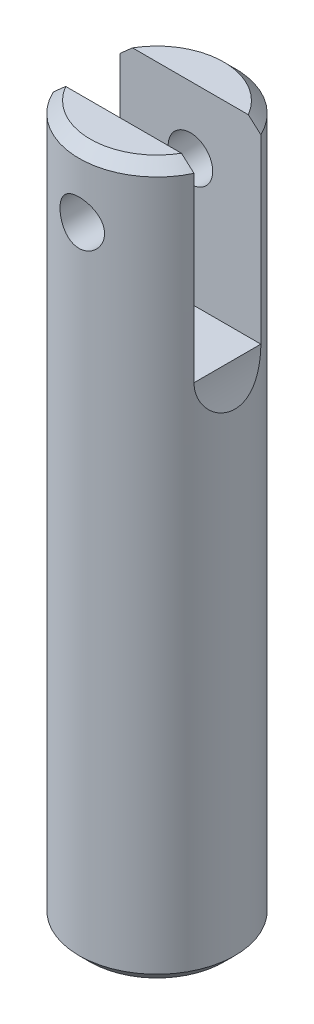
ISO-10303-21;
HEADER;
FILE_DESCRIPTION(('STEP AP214'),'2;1');
FILE_NAME('part.step','',(''),(''),'','','');
FILE_SCHEMA(('AUTOMOTIVE_DESIGN { 1 0 10303 214 1 1 1 1 }'));
ENDSEC;
DATA;
#1=APPLICATION_CONTEXT('core data for automotive mechanical design processes');
#2=APPLICATION_PROTOCOL_DEFINITION('international standard','automotive_design',2000,#1);
#3=PRODUCT_CONTEXT('',#1,'mechanical');
#4=PRODUCT('Part','Part','',(#3));
#5=PRODUCT_RELATED_PRODUCT_CATEGORY('part','',(#4));
#6=PRODUCT_DEFINITION_FORMATION('','',#4);
#7=PRODUCT_DEFINITION_CONTEXT('part definition',#1,'design');
#8=PRODUCT_DEFINITION('design','',#6,#7);
#9=PRODUCT_DEFINITION_SHAPE('','',#8);
#10=(LENGTH_UNIT() NAMED_UNIT(*) SI_UNIT(.MILLI.,.METRE.));
#11=(NAMED_UNIT(*) PLANE_ANGLE_UNIT() SI_UNIT($,.RADIAN.));
#12=(NAMED_UNIT(*) SI_UNIT($,.STERADIAN.) SOLID_ANGLE_UNIT());
#13=UNCERTAINTY_MEASURE_WITH_UNIT(LENGTH_MEASURE(1.E-05),#10,'distance_accuracy_value','');
#14=(GEOMETRIC_REPRESENTATION_CONTEXT(3) GLOBAL_UNCERTAINTY_ASSIGNED_CONTEXT((#13)) GLOBAL_UNIT_ASSIGNED_CONTEXT((#10,
#11,#12)) REPRESENTATION_CONTEXT('',''));
#15=CARTESIAN_POINT('',(0.,0.,0.));
#16=DIRECTION('',(0.,0.,1.));
#17=DIRECTION('',(1.,0.,0.));
#18=AXIS2_PLACEMENT_3D('',#15,#16,#17);
#19=CARTESIAN_POINT('',(0.,50.8,0.));
#20=DIRECTION('',(0.,1.,0.));
#21=DIRECTION('',(0.,0.,1.));
#22=AXIS2_PLACEMENT_3D('',#19,#20,#21);
#23=PLANE('',#22);
#24=DIRECTION('',(1.,0.,0.));
#25=VECTOR('',#24,1.);
#26=CARTESIAN_POINT('',(-9.95086719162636,50.8,2.38125));
#27=LINE('',#26,#25);
#28=CARTESIAN_POINT('',(-4.12444598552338,50.8,2.38125));
#29=VERTEX_POINT('',#28);
#30=CARTESIAN_POINT('',(4.12444598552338,50.8,2.38125));
#31=VERTEX_POINT('',#30);
#32=EDGE_CURVE('E118',#29,#31,#27,.T.);
#33=ORIENTED_EDGE('',*,*,#32,.F.);
#34=CARTESIAN_POINT('',(0.,50.8,0.));
#35=DIRECTION('',(0.,1.,0.));
#36=DIRECTION('',(0.,0.,1.));
#37=AXIS2_PLACEMENT_3D('',#34,#35,#36);
#38=CIRCLE('',#37,4.7625);
#39=EDGE_CURVE('E135',#29,#31,#38,.T.);
#40=ORIENTED_EDGE('',*,*,#39,.T.);
#41=EDGE_LOOP('',(#33,#40));
#42=FACE_BOUND('',#41,.T.);
#43=ADVANCED_FACE('F34',(#42),#23,.T.);
#44=CARTESIAN_POINT('',(0.,50.8,0.));
#45=DIRECTION('',(0.,-1.,0.));
#46=DIRECTION('',(0.,0.,-1.));
#47=AXIS2_PLACEMENT_3D('',#44,#45,#46);
#48=CONICAL_SURFACE('',#47,4.7625,0.785398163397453);
#49=CARTESIAN_POINT('',(-12.0070893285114,43.3215627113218,2.38125));
#50=CARTESIAN_POINT('',(-11.7072816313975,43.6156288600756,2.38125));
#51=CARTESIAN_POINT('',(-11.4072787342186,43.909496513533,2.38125));
#52=CARTESIAN_POINT('',(-10.8063076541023,44.497122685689,2.38125));
#53=CARTESIAN_POINT('',(-10.505338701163,44.7908804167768,2.38125));
#54=CARTESIAN_POINT('',(-9.89524962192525,45.3850048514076,2.38125));
#55=CARTESIAN_POINT('',(-9.58611278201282,45.6853544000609,2.38125));
#56=CARTESIAN_POINT('',(-8.96737458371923,46.2846645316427,2.38125));
#57=CARTESIAN_POINT('',(-8.6577745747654,46.5836265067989,2.38125));
#58=CARTESIAN_POINT('',(-8.06584406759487,47.1528495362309,2.38125));
#59=CARTESIAN_POINT('',(-7.78362212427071,47.4232234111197,2.38125));
#60=CARTESIAN_POINT('',(-7.2177489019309,47.9625727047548,2.38125));
#61=CARTESIAN_POINT('',(-6.93409738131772,48.2315478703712,2.38125));
#62=CARTESIAN_POINT('',(-6.36319908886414,48.7690229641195,2.38125));
#63=CARTESIAN_POINT('',(-6.07594098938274,49.0375108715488,2.38125));
#64=CARTESIAN_POINT('',(-5.49879473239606,49.5712631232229,2.38125));
#65=CARTESIAN_POINT('',(-5.20890849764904,49.8365295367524,2.38125));
#66=CARTESIAN_POINT('',(-4.77419362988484,50.2277580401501,2.38125));
#67=CARTESIAN_POINT('',(-4.6310235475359,50.3555616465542,2.38125));
#68=CARTESIAN_POINT('',(-4.34335865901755,50.6096675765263,2.38125));
#69=CARTESIAN_POINT('',(-4.19886387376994,50.7359699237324,2.38125));
#70=CARTESIAN_POINT('',(-3.90778131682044,50.9869503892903,2.38125));
#71=CARTESIAN_POINT('',(-3.76118892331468,51.1116231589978,2.38125));
#72=CARTESIAN_POINT('',(-3.46579095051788,51.3582832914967,2.38125));
#73=CARTESIAN_POINT('',(-3.31698571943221,51.4802710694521,2.38125));
#74=CARTESIAN_POINT('',(-3.01811805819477,51.7191409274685,2.38125));
#75=CARTESIAN_POINT('',(-2.86808978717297,51.8360656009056,2.38125));
#76=CARTESIAN_POINT('',(-2.56394961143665,52.064776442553,2.38125));
#77=CARTESIAN_POINT('',(-2.40983493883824,52.1765589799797,2.38125));
#78=CARTESIAN_POINT('',(-2.17489544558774,52.3380091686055,2.38125));
#79=CARTESIAN_POINT('',(-2.09613525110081,52.3906773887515,2.38125));
#80=CARTESIAN_POINT('',(-1.93700687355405,52.4935180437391,2.38125));
#81=CARTESIAN_POINT('',(-1.85663889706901,52.5436907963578,2.38125));
#82=CARTESIAN_POINT('',(-1.69411949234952,52.6408301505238,2.38125));
#83=CARTESIAN_POINT('',(-1.61197048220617,52.6878007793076,2.38125));
#84=CARTESIAN_POINT('',(-1.44551541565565,52.7777269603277,2.38125));
#85=CARTESIAN_POINT('',(-1.36121020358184,52.8206840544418,2.38125));
#86=CARTESIAN_POINT('',(-1.23931495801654,52.8782444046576,2.38125));
#87=CARTESIAN_POINT('',(-1.20271623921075,52.8949571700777,2.38125));
#88=CARTESIAN_POINT('',(-1.12904807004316,52.9273519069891,2.38125));
#89=CARTESIAN_POINT('',(-1.09197845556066,52.9430335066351,2.38125));
#90=CARTESIAN_POINT('',(-1.01737472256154,52.9732452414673,2.38125));
#91=CARTESIAN_POINT('',(-0.979840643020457,52.987775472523,2.38125));
#92=CARTESIAN_POINT('',(-0.90430758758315,53.0155626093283,2.38125));
#93=CARTESIAN_POINT('',(-0.866308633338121,53.0288195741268,2.38125));
#94=CARTESIAN_POINT('',(-0.752766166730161,53.0661122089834,2.38125));
#95=CARTESIAN_POINT('',(-0.676543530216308,53.0881355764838,2.38125));
#96=CARTESIAN_POINT('',(-0.522485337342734,53.1257467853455,2.38125));
#97=CARTESIAN_POINT('',(-0.444649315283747,53.1413327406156,2.38125));
#98=CARTESIAN_POINT('',(-0.286153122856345,53.1654231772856,2.38125));
#99=CARTESIAN_POINT('',(-0.205468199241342,53.1737684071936,2.38125));
#100=CARTESIAN_POINT('',(-0.0436891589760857,53.1822185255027,2.38125));
#101=CARTESIAN_POINT('',(0.037404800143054,53.1823263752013,2.38125));
#102=CARTESIAN_POINT('',(0.199257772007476,53.1742970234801,2.38125));
#103=CARTESIAN_POINT('',(0.280016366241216,53.1661515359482,2.38125));
#104=CARTESIAN_POINT('',(0.440388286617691,53.1421702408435,2.38125));
#105=CARTESIAN_POINT('',(0.520001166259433,53.1263315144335,2.38125));
#106=CARTESIAN_POINT('',(0.699426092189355,53.0825766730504,2.38125));
#107=CARTESIAN_POINT('',(0.79871423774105,53.0525289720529,2.38125));
#108=CARTESIAN_POINT('',(0.99417584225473,52.9836734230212,2.38125));
#109=CARTESIAN_POINT('',(1.09034780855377,52.944861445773,2.38125));
#110=CARTESIAN_POINT('',(1.2802989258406,52.8602351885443,2.38125));
#111=CARTESIAN_POINT('',(1.37405762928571,52.8143755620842,2.38125));
#112=CARTESIAN_POINT('',(1.51261599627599,52.7417167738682,2.38125));
#113=CARTESIAN_POINT('',(1.55845118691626,52.7168548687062,2.38125));
#114=CARTESIAN_POINT('',(1.64948649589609,52.6659965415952,2.38125));
#115=CARTESIAN_POINT('',(1.6946866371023,52.6400001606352,2.38125));
#116=CARTESIAN_POINT('',(1.83516527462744,52.5571356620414,2.38125));
#117=CARTESIAN_POINT('',(1.9294162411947,52.4985237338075,2.38125));
#118=CARTESIAN_POINT('',(2.11573035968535,52.3779070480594,2.38125));
#119=CARTESIAN_POINT('',(2.2077930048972,52.3159015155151,2.38125));
#120=CARTESIAN_POINT('',(2.39016718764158,52.1892311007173,2.38125));
#121=CARTESIAN_POINT('',(2.48047734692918,52.124564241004,2.38125));
#122=CARTESIAN_POINT('',(2.65959223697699,51.9931736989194,2.38125));
#123=CARTESIAN_POINT('',(2.74839686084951,51.9264498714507,2.38125));
#124=CARTESIAN_POINT('',(3.01337480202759,51.7235187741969,2.38125));
#125=CARTESIAN_POINT('',(3.18767174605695,51.5848641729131,2.38125));
#126=CARTESIAN_POINT('',(3.53277680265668,51.3032775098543,2.38125));
#127=CARTESIAN_POINT('',(3.70358449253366,51.1603449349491,2.38125));
#128=CARTESIAN_POINT('',(3.95823848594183,50.9434053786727,2.38125));
#129=CARTESIAN_POINT('',(4.04303882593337,50.8705140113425,2.38125));
#130=CARTESIAN_POINT('',(4.21207869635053,50.724093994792,2.38125));
#131=CARTESIAN_POINT('',(4.29631825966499,50.650565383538,2.38125));
#132=CARTESIAN_POINT('',(4.54834231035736,50.4291472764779,2.38125));
#133=CARTESIAN_POINT('',(4.71541126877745,50.280443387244,2.38125));
#134=CARTESIAN_POINT('',(5.04781312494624,49.9816860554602,2.38125));
#135=CARTESIAN_POINT('',(5.21314852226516,49.8316353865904,2.38125));
#136=CARTESIAN_POINT('',(5.54269480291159,49.5303049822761,2.38125));
#137=CARTESIAN_POINT('',(5.70690568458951,49.3790252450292,2.38125));
#138=CARTESIAN_POINT('',(6.13328531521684,48.9839170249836,2.38125));
#139=CARTESIAN_POINT('',(6.39475843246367,48.739338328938,2.38125));
#140=CARTESIAN_POINT('',(6.91609596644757,48.2484677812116,2.38125));
#141=CARTESIAN_POINT('',(7.17596035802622,48.0021759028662,2.38125));
#142=CARTESIAN_POINT('',(7.69467073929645,47.5081811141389,2.38125));
#143=CARTESIAN_POINT('',(7.9535159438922,47.2604773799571,2.38125));
#144=CARTESIAN_POINT('',(8.47030612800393,46.7641326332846,2.38125));
#145=CARTESIAN_POINT('',(8.72825110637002,46.5154916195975,2.38125));
#146=CARTESIAN_POINT('',(9.23873272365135,46.022041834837,2.38125));
#147=CARTESIAN_POINT('',(9.49128200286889,45.7772461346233,2.38125));
#148=CARTESIAN_POINT('',(9.99584755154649,45.2871052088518,2.38125));
#149=CARTESIAN_POINT('',(10.2478638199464,45.0417599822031,2.38125));
#150=CARTESIAN_POINT('',(10.7512821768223,44.5508100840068,2.38125));
#151=CARTESIAN_POINT('',(11.002684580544,44.3052057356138,2.38125));
#152=CARTESIAN_POINT('',(11.5051343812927,43.8136359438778,2.38125));
#153=CARTESIAN_POINT('',(11.7561817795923,43.5676705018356,2.38125));
#154=CARTESIAN_POINT('',(12.0070893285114,43.3215627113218,2.38125));
#155=B_SPLINE_CURVE_WITH_KNOTS('',3,(#49,#50,#51,#52,#53,#54,#55,#56,#57,#58,#59,#60,#61,#62,
#63,#64,#65,#66,#67,#68,#69,#70,#71,#72,#73,#74,#75,#76,#77,#78,#79,#80,#81,#82,#83,#84,#85,#86,
#87,#88,#89,#90,#91,#92,#93,#94,#95,#96,#97,#98,#99,#100,#101,#102,#103,#104,#105,#106,#107,
#108,#109,#110,#111,#112,#113,#114,#115,#116,#117,#118,#119,#120,#121,#122,#123,#124,#125,#126,
#127,#128,#129,#130,#131,#132,#133,#134,#135,#136,#137,#138,#139,#140,#141,#142,#143,#144,#145,
#146,#147,#148,#149,#150,#151,#152,#153,#154),.UNSPECIFIED.,.F.,.F.,(4,2,2,2,2,2,2,2,2,2,2,2,2,
2,2,2,2,2,2,2,2,2,2,2,2,2,2,2,2,2,2,2,2,2,2,2,2,2,2,2,2,2,2,2,2,2,2,2,2,2,2,2,4),(0.,
1.25985599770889,2.52155381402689,3.81460258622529,5.10575192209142,6.27825064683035,
7.45095465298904,8.63053048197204,9.80930361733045,10.3850415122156,10.9607703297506,
11.5380642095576,12.1152681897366,12.6858316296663,13.2567919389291,13.540999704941,
13.8251711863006,14.1089784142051,14.3926761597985,14.5133656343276,14.6340983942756,
14.754821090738,14.8755381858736,15.1133037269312,15.351138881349,15.5940812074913,
15.8369361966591,16.080035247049,16.3232266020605,16.6338881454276,16.9446963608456,
17.2575953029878,17.4140146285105,17.5704283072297,17.9032886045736,18.2362252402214,
18.569413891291,18.9026260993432,19.5706691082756,20.2387925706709,20.5742568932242,
20.9097013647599,21.5806727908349,22.250485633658,22.9202994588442,23.9943832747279,
25.0684838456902,26.1432931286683,27.2181037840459,28.2732589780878,29.3284162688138,
30.382798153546,31.4371762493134),.UNSPECIFIED.);
#156=CARTESIAN_POINT('',(-5.02011578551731,50.00625,2.38125));
#157=VERTEX_POINT('',#156);
#158=EDGE_CURVE('E11',#157,#29,#155,.T.);
#159=ORIENTED_EDGE('',*,*,#158,.F.);
#160=CARTESIAN_POINT('',(0.,50.00625,0.));
#161=DIRECTION('',(0.,1.,0.));
#162=DIRECTION('',(0.,0.,1.));
#163=AXIS2_PLACEMENT_3D('',#160,#161,#162);
#164=CIRCLE('',#163,5.55625);
#165=CARTESIAN_POINT('',(5.0201157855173,50.00625,2.38125));
#166=VERTEX_POINT('',#165);
#167=EDGE_CURVE('E142',#166,#157,#164,.F.);
#168=ORIENTED_EDGE('',*,*,#167,.F.);
#169=EDGE_CURVE('E43',#31,#166,#155,.T.);
#170=ORIENTED_EDGE('',*,*,#169,.F.);
#171=ORIENTED_EDGE('',*,*,#39,.F.);
#172=EDGE_LOOP('',(#159,#168,#170,#171));
#173=FACE_BOUND('',#172,.T.);
#174=ADVANCED_FACE('F175',(#173),#48,.T.);
#175=CARTESIAN_POINT('',(0.,50.8,0.));
#176=DIRECTION('',(0.,-1.,0.));
#177=DIRECTION('',(0.,0.,-1.));
#178=AXIS2_PLACEMENT_3D('',#175,#176,#177);
#179=CYLINDRICAL_SURFACE('',#178,5.55625);
#180=CARTESIAN_POINT('',(0.,47.625,-5.55625));
#181=CARTESIAN_POINT('',(-0.0872767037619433,47.6249984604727,-5.55624896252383));
#182=CARTESIAN_POINT('',(-0.174569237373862,47.6177786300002,-5.55417368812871));
#183=CARTESIAN_POINT('',(-0.34662426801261,47.5891508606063,-5.54609719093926));
#184=CARTESIAN_POINT('',(-0.431385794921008,47.5677375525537,-5.54009448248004));
#185=CARTESIAN_POINT('',(-0.595871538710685,47.5114873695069,-5.52482298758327));
#186=CARTESIAN_POINT('',(-0.675602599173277,47.4766692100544,-5.51555875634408));
#187=CARTESIAN_POINT('',(-0.828094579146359,47.3946712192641,-5.49473420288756));
#188=CARTESIAN_POINT('',(-0.900854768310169,47.3474900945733,-5.48317364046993));
#189=CARTESIAN_POINT('',(-1.03925246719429,47.2407972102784,-5.45865633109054));
#190=CARTESIAN_POINT('',(-1.10468070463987,47.1810201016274,-5.44567302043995));
#191=CARTESIAN_POINT('',(-1.22473351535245,47.0513983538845,-5.4199372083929));
#192=CARTESIAN_POINT('',(-1.27935646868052,46.9815522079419,-5.40718474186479));
#193=CARTESIAN_POINT('',(-1.37731333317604,46.8320488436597,-5.38307768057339));
#194=CARTESIAN_POINT('',(-1.42039833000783,46.7522226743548,-5.37175632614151));
#195=CARTESIAN_POINT('',(-1.49244979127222,46.5860828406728,-5.35218754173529));
#196=CARTESIAN_POINT('',(-1.52141929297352,46.4997705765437,-5.34393945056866));
#197=CARTESIAN_POINT('',(-1.56367506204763,46.3254449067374,-5.33172676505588));
#198=CARTESIAN_POINT('',(-1.57734439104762,46.237531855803,-5.32765776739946));
#199=CARTESIAN_POINT('',(-1.58980717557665,46.0605734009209,-5.32395277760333));
#200=CARTESIAN_POINT('',(-1.58860386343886,45.9715282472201,-5.32431582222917));
#201=CARTESIAN_POINT('',(-1.57165781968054,45.7978917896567,-5.32934096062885));
#202=CARTESIAN_POINT('',(-1.5563875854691,45.7132496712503,-5.33386333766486));
#203=CARTESIAN_POINT('',(-1.51250162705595,45.5477822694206,-5.34647257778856));
#204=CARTESIAN_POINT('',(-1.48388469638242,45.4669573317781,-5.3545597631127));
#205=CARTESIAN_POINT('',(-1.41375353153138,45.3102295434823,-5.37350385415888));
#206=CARTESIAN_POINT('',(-1.37208062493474,45.2344019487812,-5.38439452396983));
#207=CARTESIAN_POINT('',(-1.27713088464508,45.0906542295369,-5.40770140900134));
#208=CARTESIAN_POINT('',(-1.22385146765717,45.0227358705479,-5.42011796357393));
#209=CARTESIAN_POINT('',(-1.1048237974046,44.8940456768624,-5.44565086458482));
#210=CARTESIAN_POINT('',(-1.03868130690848,44.833639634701,-5.45877594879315));
#211=CARTESIAN_POINT('',(-0.897042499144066,44.7246962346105,-5.48383021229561));
#212=CARTESIAN_POINT('',(-0.82154569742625,44.6761594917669,-5.49575932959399));
#213=CARTESIAN_POINT('',(-0.662720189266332,44.5921378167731,-5.51716994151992));
#214=CARTESIAN_POINT('',(-0.579350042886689,44.5567273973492,-5.52663737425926));
#215=CARTESIAN_POINT('',(-0.407505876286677,44.5005349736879,-5.5419565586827));
#216=CARTESIAN_POINT('',(-0.319033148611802,44.4797492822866,-5.54780922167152));
#217=CARTESIAN_POINT('',(-0.142610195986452,44.4539899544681,-5.55509806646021));
#218=CARTESIAN_POINT('',(-0.0547380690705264,44.4485198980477,-5.55667285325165));
#219=CARTESIAN_POINT('',(0.120671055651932,44.4521647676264,-5.55563154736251));
#220=CARTESIAN_POINT('',(0.208208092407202,44.4612779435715,-5.55301595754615));
#221=CARTESIAN_POINT('',(0.378633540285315,44.493426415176,-5.54397804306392));
#222=CARTESIAN_POINT('',(0.461580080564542,44.5161774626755,-5.53763349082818));
#223=CARTESIAN_POINT('',(0.622465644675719,44.5746191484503,-5.52186474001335));
#224=CARTESIAN_POINT('',(0.700404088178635,44.6103112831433,-5.51244018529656));
#225=CARTESIAN_POINT('',(0.850933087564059,44.6944935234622,-5.49124156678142));
#226=CARTESIAN_POINT('',(0.923371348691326,44.743243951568,-5.47942105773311));
#227=CARTESIAN_POINT('',(1.05921058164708,44.8518379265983,-5.45479245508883));
#228=CARTESIAN_POINT('',(1.12260949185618,44.9116839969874,-5.44198413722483));
#229=CARTESIAN_POINT('',(1.24071572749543,45.0430974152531,-5.41630091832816));
#230=CARTESIAN_POINT('',(1.29507093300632,45.1149841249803,-5.40343754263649));
#231=CARTESIAN_POINT('',(1.39096378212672,45.2671359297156,-5.37955247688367));
#232=CARTESIAN_POINT('',(1.43250187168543,45.3474007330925,-5.36853072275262));
#233=CARTESIAN_POINT('',(1.50127854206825,45.5136973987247,-5.34970554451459));
#234=CARTESIAN_POINT('',(1.52859290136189,45.5996958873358,-5.34188511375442));
#235=CARTESIAN_POINT('',(1.5682868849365,45.7753322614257,-5.3303682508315));
#236=CARTESIAN_POINT('',(1.58067103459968,45.8649690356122,-5.32667056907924));
#237=CARTESIAN_POINT('',(1.58986556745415,46.0417037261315,-5.32393289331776));
#238=CARTESIAN_POINT('',(1.58724621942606,46.1287697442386,-5.32472233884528));
#239=CARTESIAN_POINT('',(1.56785239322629,46.301163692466,-5.33046461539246));
#240=CARTESIAN_POINT('',(1.55107838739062,46.3864916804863,-5.335417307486));
#241=CARTESIAN_POINT('',(1.50420362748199,46.5521503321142,-5.34881913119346));
#242=CARTESIAN_POINT('',(1.47424054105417,46.6325230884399,-5.35723208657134));
#243=CARTESIAN_POINT('',(1.4019446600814,46.7871641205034,-5.37660296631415));
#244=CARTESIAN_POINT('',(1.35960967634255,46.8614313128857,-5.38756134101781));
#245=CARTESIAN_POINT('',(1.26211446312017,47.0044331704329,-5.41124512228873));
#246=CARTESIAN_POINT('',(1.20657324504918,47.0729003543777,-5.42401730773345));
#247=CARTESIAN_POINT('',(1.08494499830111,47.1997277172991,-5.44964814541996));
#248=CARTESIAN_POINT('',(1.01885531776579,47.2580853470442,-5.46250681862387));
#249=CARTESIAN_POINT('',(0.875962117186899,47.3645207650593,-5.48725692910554));
#250=CARTESIAN_POINT('',(0.798927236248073,47.4122964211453,-5.49911508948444));
#251=CARTESIAN_POINT('',(0.637580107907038,47.4941469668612,-5.52014545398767));
#252=CARTESIAN_POINT('',(0.553271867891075,47.5282293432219,-5.52931912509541));
#253=CARTESIAN_POINT('',(0.391252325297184,47.5780477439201,-5.54297329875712));
#254=CARTESIAN_POINT('',(0.31413688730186,47.5956102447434,-5.54791311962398));
#255=CARTESIAN_POINT('',(0.158018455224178,47.619086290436,-5.55455172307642));
#256=CARTESIAN_POINT('',(0.0790157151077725,47.6250013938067,-5.55625093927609));
#257=CARTESIAN_POINT('',(0.,47.625,-5.55625));
#258=B_SPLINE_CURVE_WITH_KNOTS('',3,(#180,#181,#182,#183,#184,#185,#186,#187,#188,#189,#190,
#191,#192,#193,#194,#195,#196,#197,#198,#199,#200,#201,#202,#203,#204,#205,#206,#207,#208,#209,
#210,#211,#212,#213,#214,#215,#216,#217,#218,#219,#220,#221,#222,#223,#224,#225,#226,#227,#228,
#229,#230,#231,#232,#233,#234,#235,#236,#237,#238,#239,#240,#241,#242,#243,#244,#245,#246,#247,
#248,#249,#250,#251,#252,#253,#254,#255,#256,#257),.UNSPECIFIED.,.T.,.F.,(4,2,2,2,2,2,2,2,2,2,2,
2,2,2,2,2,2,2,2,2,2,2,2,2,2,2,2,2,2,2,2,2,2,2,2,2,2,2,4),(0.,0.261540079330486,
0.523179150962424,0.78445424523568,1.04575668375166,1.31324200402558,1.5807673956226,
1.85366878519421,2.12651142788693,2.39235860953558,2.65814801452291,2.91532298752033,
3.17252121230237,3.43297512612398,3.69348706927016,3.96381684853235,4.23416063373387,
4.50601636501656,4.77780353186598,5.04067332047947,5.30351156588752,5.56105330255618,
5.81862482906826,6.08177223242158,6.34497955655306,6.6167960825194,6.88860315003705,
7.15894692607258,7.42920873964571,7.68926803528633,7.94931865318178,8.20671695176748,
8.46416082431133,8.73019952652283,8.99630521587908,9.26923770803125,9.54202077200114,
9.77883702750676,10.0156215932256),.UNSPECIFIED.);
#259=CARTESIAN_POINT('',(0.,47.625,-5.55625));
#260=VERTEX_POINT('',#259);
#261=EDGE_CURVE('E95',#260,#260,#258,.T.);
#262=ORIENTED_EDGE('',*,*,#261,.T.);
#263=EDGE_LOOP('',(#262));
#264=FACE_BOUND('',#263,.T.);
#265=CARTESIAN_POINT('',(1.5875,46.0375,5.32463687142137));
#266=CARTESIAN_POINT('',(1.58749842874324,45.9503053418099,5.32463809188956));
#267=CARTESIAN_POINT('',(1.58029169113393,45.863094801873,5.32680211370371));
#268=CARTESIAN_POINT('',(1.55172063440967,45.6912097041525,5.33519371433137));
#269=CARTESIAN_POINT('',(1.53035055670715,45.6065361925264,5.34142294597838));
#270=CARTESIAN_POINT('',(1.47422666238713,45.4422373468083,5.35718313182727));
#271=CARTESIAN_POINT('',(1.43949357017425,45.3626044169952,5.36670897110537));
#272=CARTESIAN_POINT('',(1.35769638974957,45.2102792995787,5.38798231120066));
#273=CARTESIAN_POINT('',(1.31063083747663,45.1375879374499,5.39973007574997));
#274=CARTESIAN_POINT('',(1.20405906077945,44.9991229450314,5.42450165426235));
#275=CARTESIAN_POINT('',(1.14426143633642,44.9335780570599,5.43755068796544));
#276=CARTESIAN_POINT('',(1.01454842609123,44.8132971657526,5.46323810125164));
#277=CARTESIAN_POINT('',(0.944631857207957,44.7585624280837,5.47587643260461));
#278=CARTESIAN_POINT('',(0.795056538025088,44.6604797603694,5.499602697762));
#279=CARTESIAN_POINT('',(0.715240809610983,44.6173624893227,5.51065743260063));
#280=CARTESIAN_POINT('',(0.549122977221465,44.5452485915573,5.5296795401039));
#281=CARTESIAN_POINT('',(0.46282213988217,44.5162492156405,5.53764751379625));
#282=CARTESIAN_POINT('',(0.288574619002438,44.473943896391,5.54941993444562));
#283=CARTESIAN_POINT('',(0.200729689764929,44.4602480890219,5.55332762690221));
#284=CARTESIAN_POINT('',(0.0239078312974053,44.4477086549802,5.55690163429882));
#285=CARTESIAN_POINT('',(-0.065068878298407,44.4488621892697,5.55656875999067));
#286=CARTESIAN_POINT('',(-0.238903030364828,44.4657213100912,5.55177330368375));
#287=CARTESIAN_POINT('',(-0.323805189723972,44.4810051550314,5.5474304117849));
#288=CARTESIAN_POINT('',(-0.489785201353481,44.5250054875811,5.53524647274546));
#289=CARTESIAN_POINT('',(-0.570862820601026,44.5537227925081,5.52740521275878));
#290=CARTESIAN_POINT('',(-0.727927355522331,44.6240768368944,5.50893481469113));
#291=CARTESIAN_POINT('',(-0.803848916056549,44.6658514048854,5.49827613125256));
#292=CARTESIAN_POINT('',(-0.947743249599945,44.7610266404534,5.47530947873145));
#293=CARTESIAN_POINT('',(-1.01571427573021,44.8144298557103,5.4630011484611));
#294=CARTESIAN_POINT('',(-1.14429591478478,44.9335570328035,5.43755010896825));
#295=CARTESIAN_POINT('',(-1.20456450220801,44.999647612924,5.42439327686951));
#296=CARTESIAN_POINT('',(-1.31325383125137,45.1411301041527,5.39911110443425));
#297=CARTESIAN_POINT('',(-1.36167361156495,45.2165227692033,5.38698584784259));
#298=CARTESIAN_POINT('',(-1.44560397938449,45.3752988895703,5.36507670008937));
#299=CARTESIAN_POINT('',(-1.48100841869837,45.4587413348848,5.35531227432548));
#300=CARTESIAN_POINT('',(-1.53716792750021,45.6307453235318,5.33946532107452));
#301=CARTESIAN_POINT('',(-1.55792725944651,45.7193053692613,5.33338172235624));
#302=CARTESIAN_POINT('',(-1.58359012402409,45.8958000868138,5.32581735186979));
#303=CARTESIAN_POINT('',(-1.589009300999,45.9836534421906,5.32418695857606));
#304=CARTESIAN_POINT('',(-1.58526953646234,46.1590138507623,5.32530176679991));
#305=CARTESIAN_POINT('',(-1.5761124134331,46.2465209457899,5.32804642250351));
#306=CARTESIAN_POINT('',(-1.5439372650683,46.4166277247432,5.33745622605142));
#307=CARTESIAN_POINT('',(-1.52124141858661,46.4992938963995,5.34403016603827));
#308=CARTESIAN_POINT('',(-1.46300159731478,46.6596427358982,5.36026569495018));
#309=CARTESIAN_POINT('',(-1.42745576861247,46.7373246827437,5.36992772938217));
#310=CARTESIAN_POINT('',(-1.34351684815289,46.8876237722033,5.39154836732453));
#311=CARTESIAN_POINT('',(-1.29482764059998,46.9600680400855,5.40355787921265));
#312=CARTESIAN_POINT('',(-1.18634243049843,47.0959468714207,5.42840645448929));
#313=CARTESIAN_POINT('',(-1.12654402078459,47.1593794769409,5.44124569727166));
#314=CARTESIAN_POINT('',(-0.995130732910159,47.2776386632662,5.46683189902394));
#315=CARTESIAN_POINT('',(-0.923184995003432,47.3321022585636,5.47956109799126));
#316=CARTESIAN_POINT('',(-0.770878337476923,47.4281862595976,5.50305269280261));
#317=CARTESIAN_POINT('',(-0.690517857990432,47.4698073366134,5.51381519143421));
#318=CARTESIAN_POINT('',(-0.524218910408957,47.5386275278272,5.53209225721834));
#319=CARTESIAN_POINT('',(-0.438328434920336,47.565935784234,5.53963132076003));
#320=CARTESIAN_POINT('',(-0.262926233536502,47.60565377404,5.55072025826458));
#321=CARTESIAN_POINT('',(-0.173415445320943,47.6180673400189,5.55427115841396));
#322=CARTESIAN_POINT('',(0.00331647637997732,47.6273744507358,5.55692734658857));
#323=CARTESIAN_POINT('',(0.0905078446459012,47.6247969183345,5.55618414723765));
#324=CARTESIAN_POINT('',(0.263163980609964,47.6054433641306,5.55068636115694));
#325=CARTESIAN_POINT('',(0.348628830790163,47.5886680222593,5.54593196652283));
#326=CARTESIAN_POINT('',(0.51467078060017,47.541710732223,5.53298361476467));
#327=CARTESIAN_POINT('',(0.595284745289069,47.5116499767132,5.52482078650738));
#328=CARTESIAN_POINT('',(0.750369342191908,47.4390829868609,5.50590318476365));
#329=CARTESIAN_POINT('',(0.824839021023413,47.3965748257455,5.49514801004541));
#330=CARTESIAN_POINT('',(0.967925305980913,47.2988502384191,5.47178670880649));
#331=CARTESIAN_POINT('',(1.03630200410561,47.2432934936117,5.4591350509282));
#332=CARTESIAN_POINT('',(1.16293997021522,47.1216758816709,5.43356851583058));
#333=CARTESIAN_POINT('',(1.22119843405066,47.0556121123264,5.42065356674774));
#334=CARTESIAN_POINT('',(1.32747421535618,46.9127705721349,5.39562704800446));
#335=CARTESIAN_POINT('',(1.37518232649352,46.8357569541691,5.38354549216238));
#336=CARTESIAN_POINT('',(1.45691180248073,46.6744670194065,5.36200703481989));
#337=CARTESIAN_POINT('',(1.49094082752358,46.5901947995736,5.35254866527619));
#338=CARTESIAN_POINT('',(1.54065711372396,46.4282998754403,5.33843277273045));
#339=CARTESIAN_POINT('',(1.55817808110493,46.3512770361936,5.33330498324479));
#340=CARTESIAN_POINT('',(1.58159931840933,46.1953402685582,5.32640674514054));
#341=CARTESIAN_POINT('',(1.58750142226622,46.1164266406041,5.32463576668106));
#342=CARTESIAN_POINT('',(1.5875,46.0375,5.32463687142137));
#343=B_SPLINE_CURVE_WITH_KNOTS('',3,(#265,#266,#267,#268,#269,#270,#271,#272,#273,#274,#275,
#276,#277,#278,#279,#280,#281,#282,#283,#284,#285,#286,#287,#288,#289,#290,#291,#292,#293,#294,
#295,#296,#297,#298,#299,#300,#301,#302,#303,#304,#305,#306,#307,#308,#309,#310,#311,#312,#313,
#314,#315,#316,#317,#318,#319,#320,#321,#322,#323,#324,#325,#326,#327,#328,#329,#330,#331,#332,
#333,#334,#335,#336,#337,#338,#339,#340,#341,#342),.UNSPECIFIED.,.T.,.F.,(4,2,2,2,2,2,2,2,2,2,2,
2,2,2,2,2,2,2,2,2,2,2,2,2,2,2,2,2,2,2,2,2,2,2,2,2,2,2,4),(0.,0.261293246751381,
0.522692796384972,0.783688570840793,1.04471534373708,1.31252251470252,1.58036102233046,
1.8531798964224,2.12594562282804,2.39159177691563,2.65718714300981,2.91510273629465,
3.17303402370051,3.43378554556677,3.69459425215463,3.96455592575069,4.23453949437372,
4.50667850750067,4.77873828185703,5.0415377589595,5.30430445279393,5.56105448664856,
5.81784157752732,6.0809822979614,6.34418010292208,6.61626652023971,6.88833871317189,
7.15830487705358,7.42820156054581,7.68863475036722,7.94905546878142,8.20714808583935,
8.46528067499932,8.73108941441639,8.99697170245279,9.26983804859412,9.54255137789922,
9.77910548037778,10.0156222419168),.UNSPECIFIED.);
#344=CARTESIAN_POINT('',(1.5875,46.0375,5.32463687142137));
#345=VERTEX_POINT('',#344);
#346=EDGE_CURVE('E187',#345,#345,#343,.T.);
#347=ORIENTED_EDGE('',*,*,#346,.T.);
#348=EDGE_LOOP('',(#347));
#349=FACE_BOUND('',#348,.T.);
#350=DIRECTION('',(0.,-1.,0.));
#351=VECTOR('',#350,1.);
#352=CARTESIAN_POINT('',(5.0201157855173,50.8,-2.38125));
#353=LINE('',#352,#351);
#354=CARTESIAN_POINT('',(5.02011578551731,50.00625,-2.38125));
#355=VERTEX_POINT('',#354);
#356=CARTESIAN_POINT('',(5.0201157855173,37.084,-2.38125));
#357=VERTEX_POINT('',#356);
#358=EDGE_CURVE('E113',#355,#357,#353,.T.);
#359=ORIENTED_EDGE('',*,*,#358,.T.);
#360=CARTESIAN_POINT('',(5.0201157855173,37.084,-2.38124999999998));
#361=CARTESIAN_POINT('',(5.02010535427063,37.0096249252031,-2.3812472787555));
#362=CARTESIAN_POINT('',(5.02142229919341,36.9352507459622,-2.37849494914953));
#363=CARTESIAN_POINT('',(5.02663447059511,36.7869928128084,-2.36747296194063));
#364=CARTESIAN_POINT('',(5.030530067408,36.713109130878,-2.3592025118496));
#365=CARTESIAN_POINT('',(5.04083324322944,36.5661968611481,-2.33710425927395));
#366=CARTESIAN_POINT('',(5.04724579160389,36.4931702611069,-2.32326546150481));
#367=CARTESIAN_POINT('',(5.06241583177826,36.3486688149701,-2.29001949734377));
#368=CARTESIAN_POINT('',(5.07117320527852,36.2771938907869,-2.27061261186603));
#369=CARTESIAN_POINT('',(5.10069417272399,36.0656481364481,-2.20391676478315));
#370=CARTESIAN_POINT('',(5.12469897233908,35.9285593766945,-2.14816778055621));
#371=CARTESIAN_POINT('',(5.17873984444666,35.6672458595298,-2.01438010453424));
#372=CARTESIAN_POINT('',(5.20876899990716,35.5430065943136,-1.93636693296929));
#373=CARTESIAN_POINT('',(5.27009649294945,35.3160777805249,-1.76242342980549));
#374=CARTESIAN_POINT('',(5.30129876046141,35.2127338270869,-1.66731648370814));
#375=CARTESIAN_POINT('',(5.36228628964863,35.0253032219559,-1.45928073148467));
#376=CARTESIAN_POINT('',(5.39207180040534,34.9412131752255,-1.34635507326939));
#377=CARTESIAN_POINT('',(5.44453195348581,34.8003129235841,-1.11448890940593));
#378=CARTESIAN_POINT('',(5.46756172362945,34.7419875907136,-0.996547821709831));
#379=CARTESIAN_POINT('',(5.5065917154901,34.6459072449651,-0.751483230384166));
#380=CARTESIAN_POINT('',(5.52259376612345,34.6081468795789,-0.624362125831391));
#381=CARTESIAN_POINT('',(5.54528989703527,34.5552256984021,-0.37044322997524));
#382=CARTESIAN_POINT('',(5.55235327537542,34.5391662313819,-0.243864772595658));
#383=CARTESIAN_POINT('',(5.55769459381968,34.5269883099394,0.0104282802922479));
#384=CARTESIAN_POINT('',(5.55597341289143,34.5308678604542,0.138142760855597));
#385=CARTESIAN_POINT('',(5.54399749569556,34.5583200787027,0.389402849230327));
#386=CARTESIAN_POINT('',(5.53384948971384,34.5816464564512,0.512980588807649));
#387=CARTESIAN_POINT('',(5.50617248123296,34.6472144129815,0.754130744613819));
#388=CARTESIAN_POINT('',(5.48864396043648,34.6894547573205,0.871703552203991));
#389=CARTESIAN_POINT('',(5.44786022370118,34.7921799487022,1.09820327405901));
#390=CARTESIAN_POINT('',(5.42457784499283,34.852751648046,1.20708584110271));
#391=CARTESIAN_POINT('',(5.37466499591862,34.9905763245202,1.41283979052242));
#392=CARTESIAN_POINT('',(5.34803433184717,35.0678302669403,1.5097104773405));
#393=CARTESIAN_POINT('',(5.29330220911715,35.2392445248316,1.6917923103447));
#394=CARTESIAN_POINT('',(5.26518046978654,35.3337999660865,1.77662466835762));
#395=CARTESIAN_POINT('',(5.21087471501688,35.5357189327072,1.93011568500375));
#396=CARTESIAN_POINT('',(5.18469130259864,35.6430864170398,1.99876932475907));
#397=CARTESIAN_POINT('',(5.135250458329,35.8741697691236,2.12269571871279));
#398=CARTESIAN_POINT('',(5.11224617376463,35.9984695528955,2.17697805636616));
#399=CARTESIAN_POINT('',(5.07316002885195,36.2547563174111,2.26657420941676));
#400=CARTESIAN_POINT('',(5.05707859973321,36.3867437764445,2.30188684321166));
#401=CARTESIAN_POINT('',(5.03689100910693,36.6134457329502,2.3456406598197));
#402=CARTESIAN_POINT('',(5.0306190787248,36.7070560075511,2.3590156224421));
#403=CARTESIAN_POINT('',(5.02222409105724,36.8951036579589,2.37680540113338));
#404=CARTESIAN_POINT('',(5.02009204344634,36.9895387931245,2.38123963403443));
#405=CARTESIAN_POINT('',(5.0201157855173,37.084,2.38125));
#406=B_SPLINE_CURVE_WITH_KNOTS('',3,(#360,#361,#362,#363,#364,#365,#366,#367,#368,#369,#370,
#371,#372,#373,#374,#375,#376,#377,#378,#379,#380,#381,#382,#383,#384,#385,#386,#387,#388,#389,
#390,#391,#392,#393,#394,#395,#396,#397,#398,#399,#400,#401,#402,#403,#404,#405),.UNSPECIFIED.,
.F.,.F.,(4,2,2,2,2,2,2,2,2,2,2,2,2,2,2,2,2,2,2,2,2,2,4),(0.,0.223060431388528,0.446152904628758,
0.669688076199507,0.893211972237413,1.34056914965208,1.78741559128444,2.21672418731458,
2.64595702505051,3.04465392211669,3.44324699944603,3.82476873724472,4.20625230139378,
4.58297657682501,4.95967626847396,5.33818943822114,5.71672451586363,6.10533093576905,
6.49405774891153,6.9050271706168,7.3160221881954,7.59984114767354,7.88304306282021),.UNSPECIFIED.);
#407=CARTESIAN_POINT('',(5.0201157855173,37.084,2.38125000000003));
#408=VERTEX_POINT('',#407);
#409=EDGE_CURVE('E107',#357,#408,#406,.T.);
#410=ORIENTED_EDGE('',*,*,#409,.T.);
#411=DIRECTION('',(0.,-1.,0.));
#412=VECTOR('',#411,1.);
#413=CARTESIAN_POINT('',(5.0201157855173,50.8,2.38125));
#414=LINE('',#413,#412);
#415=EDGE_CURVE('E131',#408,#166,#414,.F.);
#416=ORIENTED_EDGE('',*,*,#415,.T.);
#417=ORIENTED_EDGE('',*,*,#167,.T.);
#418=DIRECTION('',(0.,-1.,0.));
#419=VECTOR('',#418,1.);
#420=CARTESIAN_POINT('',(-5.0201157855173,50.8,2.38125));
#421=LINE('',#420,#419);
#422=CARTESIAN_POINT('',(-5.0201157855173,37.084,2.38125));
#423=VERTEX_POINT('',#422);
#424=EDGE_CURVE('E57',#157,#423,#421,.T.);
#425=ORIENTED_EDGE('',*,*,#424,.T.);
#426=CARTESIAN_POINT('',(-5.0201157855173,37.084,2.38125000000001));
#427=CARTESIAN_POINT('',(-5.02010535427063,37.0096249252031,2.38124727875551));
#428=CARTESIAN_POINT('',(-5.02142229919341,36.9352507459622,2.37849494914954));
#429=CARTESIAN_POINT('',(-5.02663447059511,36.7869928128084,2.36747296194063));
#430=CARTESIAN_POINT('',(-5.030530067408,36.713109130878,2.35920251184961));
#431=CARTESIAN_POINT('',(-5.04083324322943,36.5661968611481,2.33710425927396));
#432=CARTESIAN_POINT('',(-5.04724579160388,36.4931702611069,2.32326546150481));
#433=CARTESIAN_POINT('',(-5.06241583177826,36.3486688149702,2.29001949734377));
#434=CARTESIAN_POINT('',(-5.07117320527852,36.2771938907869,2.27061261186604));
#435=CARTESIAN_POINT('',(-5.10069417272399,36.0656481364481,2.20391676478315));
#436=CARTESIAN_POINT('',(-5.12469897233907,35.9285593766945,2.14816778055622));
#437=CARTESIAN_POINT('',(-5.17873984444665,35.6672458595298,2.01438010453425));
#438=CARTESIAN_POINT('',(-5.20876899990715,35.5430065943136,1.9363669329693));
#439=CARTESIAN_POINT('',(-5.27009649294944,35.3160777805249,1.76242342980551));
#440=CARTESIAN_POINT('',(-5.30129876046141,35.2127338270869,1.66731648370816));
#441=CARTESIAN_POINT('',(-5.36228628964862,35.0253032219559,1.45928073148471));
#442=CARTESIAN_POINT('',(-5.39207180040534,34.9412131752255,1.34635507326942));
#443=CARTESIAN_POINT('',(-5.4445319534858,34.8003129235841,1.11448890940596));
#444=CARTESIAN_POINT('',(-5.46756172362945,34.7419875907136,0.996547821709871));
#445=CARTESIAN_POINT('',(-5.50659171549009,34.6459072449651,0.751483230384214));
#446=CARTESIAN_POINT('',(-5.52259376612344,34.6081468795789,0.624362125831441));
#447=CARTESIAN_POINT('',(-5.54528989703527,34.5552256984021,0.370443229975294));
#448=CARTESIAN_POINT('',(-5.55235327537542,34.5391662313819,0.243864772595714));
#449=CARTESIAN_POINT('',(-5.55769459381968,34.5269883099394,-0.0104282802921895));
#450=CARTESIAN_POINT('',(-5.55597341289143,34.5308678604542,-0.138142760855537));
#451=CARTESIAN_POINT('',(-5.54399749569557,34.5583200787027,-0.389402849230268));
#452=CARTESIAN_POINT('',(-5.53384948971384,34.5816464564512,-0.512980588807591));
#453=CARTESIAN_POINT('',(-5.50617248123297,34.6472144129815,-0.754130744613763));
#454=CARTESIAN_POINT('',(-5.48864396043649,34.6894547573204,-0.871703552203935));
#455=CARTESIAN_POINT('',(-5.44786022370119,34.7921799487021,-1.09820327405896));
#456=CARTESIAN_POINT('',(-5.42457784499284,34.852751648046,-1.20708584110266));
#457=CARTESIAN_POINT('',(-5.37466499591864,34.9905763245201,-1.41283979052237));
#458=CARTESIAN_POINT('',(-5.34803433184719,35.0678302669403,-1.50971047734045));
#459=CARTESIAN_POINT('',(-5.29330220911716,35.2392445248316,-1.69179231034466));
#460=CARTESIAN_POINT('',(-5.26518046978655,35.3337999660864,-1.77662466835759));
#461=CARTESIAN_POINT('',(-5.21087471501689,35.5357189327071,-1.93011568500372));
#462=CARTESIAN_POINT('',(-5.18469130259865,35.6430864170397,-1.99876932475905));
#463=CARTESIAN_POINT('',(-5.13525045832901,35.8741697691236,-2.12269571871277));
#464=CARTESIAN_POINT('',(-5.11224617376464,35.9984695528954,-2.17697805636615));
#465=CARTESIAN_POINT('',(-5.07316002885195,36.2547563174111,-2.26657420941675));
#466=CARTESIAN_POINT('',(-5.05707859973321,36.3867437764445,-2.30188684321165));
#467=CARTESIAN_POINT('',(-5.03689100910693,36.6134457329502,-2.34564065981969));
#468=CARTESIAN_POINT('',(-5.03061907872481,36.7070560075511,-2.3590156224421));
#469=CARTESIAN_POINT('',(-5.02222409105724,36.8951036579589,-2.37680540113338));
#470=CARTESIAN_POINT('',(-5.02009204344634,36.9895387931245,-2.38123963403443));
#471=CARTESIAN_POINT('',(-5.0201157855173,37.084,-2.38125));
#472=B_SPLINE_CURVE_WITH_KNOTS('',3,(#426,#427,#428,#429,#430,#431,#432,#433,#434,#435,#436,
#437,#438,#439,#440,#441,#442,#443,#444,#445,#446,#447,#448,#449,#450,#451,#452,#453,#454,#455,
#456,#457,#458,#459,#460,#461,#462,#463,#464,#465,#466,#467,#468,#469,#470,#471),.UNSPECIFIED.,
.F.,.F.,(4,2,2,2,2,2,2,2,2,2,2,2,2,2,2,2,2,2,2,2,2,2,4),(0.,0.223060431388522,0.446152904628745,
0.669688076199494,0.8932119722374,1.34056914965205,1.78741559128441,2.21672418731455,
2.64595702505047,3.04465392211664,3.44324699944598,3.82476873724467,4.20625230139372,
4.58297657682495,4.9596762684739,5.33818943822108,5.71672451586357,6.105330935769,
6.49405774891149,6.90502717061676,7.31602218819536,7.59984114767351,7.88304306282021),.UNSPECIFIED.);
#473=CARTESIAN_POINT('',(-5.0201157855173,37.084,-2.38124999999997));
#474=VERTEX_POINT('',#473);
#475=EDGE_CURVE('E90',#423,#474,#472,.T.);
#476=ORIENTED_EDGE('',*,*,#475,.T.);
#477=DIRECTION('',(0.,-1.,0.));
#478=VECTOR('',#477,1.);
#479=CARTESIAN_POINT('',(-5.0201157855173,50.8,-2.38125));
#480=LINE('',#479,#478);
#481=CARTESIAN_POINT('',(-5.0201157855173,50.00625,-2.38125));
#482=VERTEX_POINT('',#481);
#483=EDGE_CURVE('E104',#474,#482,#480,.F.);
#484=ORIENTED_EDGE('',*,*,#483,.T.);
#485=EDGE_CURVE('E144',#482,#355,#164,.F.);
#486=ORIENTED_EDGE('',*,*,#485,.T.);
#487=EDGE_LOOP('',(#359,#410,#416,#417,#425,#476,#484,#486));
#488=FACE_BOUND('',#487,.T.);
#489=CARTESIAN_POINT('',(0.,0.79375000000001,0.));
#490=DIRECTION('',(0.,1.,0.));
#491=DIRECTION('',(0.,0.,1.));
#492=AXIS2_PLACEMENT_3D('',#489,#490,#491);
#493=CIRCLE('',#492,5.55625);
#494=CARTESIAN_POINT('',(0.,0.79375000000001,5.55625));
#495=VERTEX_POINT('',#494);
#496=EDGE_CURVE('E139',#495,#495,#493,.T.);
#497=ORIENTED_EDGE('',*,*,#496,.T.);
#498=EDGE_LOOP('',(#497));
#499=FACE_BOUND('',#498,.T.);
#500=ADVANCED_FACE('F101',(#264,#349,#488,#499),#179,.T.);
#501=DIRECTION('',(-1.,0.,0.));
#502=VECTOR('',#501,1.);
#503=CARTESIAN_POINT('',(-9.95086719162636,50.8,-2.38125));
#504=LINE('',#503,#502);
#505=CARTESIAN_POINT('',(4.12444598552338,50.8,-2.38125));
#506=VERTEX_POINT('',#505);
#507=CARTESIAN_POINT('',(-4.12444598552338,50.8,-2.38125));
#508=VERTEX_POINT('',#507);
#509=EDGE_CURVE('E50',#506,#508,#504,.T.);
#510=ORIENTED_EDGE('',*,*,#509,.F.);
#511=EDGE_CURVE('E138',#506,#508,#38,.T.);
#512=ORIENTED_EDGE('',*,*,#511,.T.);
#513=EDGE_LOOP('',(#510,#512));
#514=FACE_BOUND('',#513,.T.);
#515=ADVANCED_FACE('F166',(#514),#23,.T.);
#516=CARTESIAN_POINT('',(0.,0.,0.));
#517=DIRECTION('',(0.,1.,0.));
#518=DIRECTION('',(0.,0.,1.));
#519=AXIS2_PLACEMENT_3D('',#516,#517,#518);
#520=PLANE('',#519);
#521=CARTESIAN_POINT('',(0.,0.,0.));
#522=DIRECTION('',(0.,1.,0.));
#523=DIRECTION('',(0.,0.,1.));
#524=AXIS2_PLACEMENT_3D('',#521,#522,#523);
#525=CIRCLE('',#524,4.76249999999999);
#526=CARTESIAN_POINT('',(0.,0.,4.76249999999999));
#527=VERTEX_POINT('',#526);
#528=EDGE_CURVE('E145',#527,#527,#525,.F.);
#529=ORIENTED_EDGE('',*,*,#528,.T.);
#530=EDGE_LOOP('',(#529));
#531=FACE_BOUND('',#530,.T.);
#532=ADVANCED_FACE('F169',(#531),#520,.F.);
#533=CARTESIAN_POINT('',(12.0070893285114,43.3215627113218,-2.38125));
#534=CARTESIAN_POINT('',(11.7072816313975,43.6156288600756,-2.38125));
#535=CARTESIAN_POINT('',(11.4072787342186,43.909496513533,-2.38125));
#536=CARTESIAN_POINT('',(10.8063076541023,44.497122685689,-2.38125));
#537=CARTESIAN_POINT('',(10.505338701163,44.7908804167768,-2.38125));
#538=CARTESIAN_POINT('',(9.89524962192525,45.3850048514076,-2.38125));
#539=CARTESIAN_POINT('',(9.58611278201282,45.6853544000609,-2.38125));
#540=CARTESIAN_POINT('',(8.96737458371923,46.2846645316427,-2.38125));
#541=CARTESIAN_POINT('',(8.6577745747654,46.5836265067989,-2.38125));
#542=CARTESIAN_POINT('',(8.06584406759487,47.1528495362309,-2.38125));
#543=CARTESIAN_POINT('',(7.78362212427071,47.4232234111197,-2.38125));
#544=CARTESIAN_POINT('',(7.2177489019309,47.9625727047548,-2.38125));
#545=CARTESIAN_POINT('',(6.93409738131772,48.2315478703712,-2.38125));
#546=CARTESIAN_POINT('',(6.36319908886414,48.7690229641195,-2.38125));
#547=CARTESIAN_POINT('',(6.07594098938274,49.0375108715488,-2.38125));
#548=CARTESIAN_POINT('',(5.49879473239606,49.5712631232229,-2.38125));
#549=CARTESIAN_POINT('',(5.20890849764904,49.8365295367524,-2.38125));
#550=CARTESIAN_POINT('',(4.77419362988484,50.2277580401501,-2.38125));
#551=CARTESIAN_POINT('',(4.6310235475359,50.3555616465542,-2.38125));
#552=CARTESIAN_POINT('',(4.34335865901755,50.6096675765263,-2.38125));
#553=CARTESIAN_POINT('',(4.19886387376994,50.7359699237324,-2.38125));
#554=CARTESIAN_POINT('',(3.90778131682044,50.9869503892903,-2.38125));
#555=CARTESIAN_POINT('',(3.76118892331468,51.1116231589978,-2.38125));
#556=CARTESIAN_POINT('',(3.46579095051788,51.3582832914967,-2.38125));
#557=CARTESIAN_POINT('',(3.31698571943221,51.4802710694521,-2.38125));
#558=CARTESIAN_POINT('',(3.01811805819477,51.7191409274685,-2.38125));
#559=CARTESIAN_POINT('',(2.86808978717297,51.8360656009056,-2.38125));
#560=CARTESIAN_POINT('',(2.56394961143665,52.064776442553,-2.38125));
#561=CARTESIAN_POINT('',(2.40983493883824,52.1765589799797,-2.38125));
#562=CARTESIAN_POINT('',(2.17489544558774,52.3380091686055,-2.38125));
#563=CARTESIAN_POINT('',(2.09613525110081,52.3906773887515,-2.38125));
#564=CARTESIAN_POINT('',(1.93700687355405,52.4935180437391,-2.38125));
#565=CARTESIAN_POINT('',(1.85663889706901,52.5436907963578,-2.38125));
#566=CARTESIAN_POINT('',(1.69411949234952,52.6408301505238,-2.38125));
#567=CARTESIAN_POINT('',(1.61197048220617,52.6878007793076,-2.38125));
#568=CARTESIAN_POINT('',(1.44551541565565,52.7777269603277,-2.38125));
#569=CARTESIAN_POINT('',(1.36121020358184,52.8206840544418,-2.38125));
#570=CARTESIAN_POINT('',(1.23931495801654,52.8782444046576,-2.38125));
#571=CARTESIAN_POINT('',(1.20271623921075,52.8949571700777,-2.38125));
#572=CARTESIAN_POINT('',(1.12904807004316,52.9273519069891,-2.38125));
#573=CARTESIAN_POINT('',(1.09197845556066,52.9430335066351,-2.38125));
#574=CARTESIAN_POINT('',(1.01737472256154,52.9732452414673,-2.38125));
#575=CARTESIAN_POINT('',(0.979840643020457,52.987775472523,-2.38125));
#576=CARTESIAN_POINT('',(0.90430758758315,53.0155626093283,-2.38125));
#577=CARTESIAN_POINT('',(0.866308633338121,53.0288195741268,-2.38125));
#578=CARTESIAN_POINT('',(0.752766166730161,53.0661122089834,-2.38125));
#579=CARTESIAN_POINT('',(0.676543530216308,53.0881355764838,-2.38125));
#580=CARTESIAN_POINT('',(0.522485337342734,53.1257467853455,-2.38125));
#581=CARTESIAN_POINT('',(0.444649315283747,53.1413327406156,-2.38125));
#582=CARTESIAN_POINT('',(0.286153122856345,53.1654231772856,-2.38125));
#583=CARTESIAN_POINT('',(0.205468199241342,53.1737684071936,-2.38125));
#584=CARTESIAN_POINT('',(0.0436891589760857,53.1822185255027,-2.38125));
#585=CARTESIAN_POINT('',(-0.037404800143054,53.1823263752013,-2.38125));
#586=CARTESIAN_POINT('',(-0.199257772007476,53.1742970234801,-2.38125));
#587=CARTESIAN_POINT('',(-0.280016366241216,53.1661515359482,-2.38125));
#588=CARTESIAN_POINT('',(-0.440388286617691,53.1421702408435,-2.38125));
#589=CARTESIAN_POINT('',(-0.520001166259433,53.1263315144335,-2.38125));
#590=CARTESIAN_POINT('',(-0.699426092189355,53.0825766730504,-2.38125));
#591=CARTESIAN_POINT('',(-0.79871423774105,53.0525289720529,-2.38125));
#592=CARTESIAN_POINT('',(-0.99417584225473,52.9836734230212,-2.38125));
#593=CARTESIAN_POINT('',(-1.09034780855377,52.944861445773,-2.38125));
#594=CARTESIAN_POINT('',(-1.2802989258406,52.8602351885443,-2.38125));
#595=CARTESIAN_POINT('',(-1.37405762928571,52.8143755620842,-2.38125));
#596=CARTESIAN_POINT('',(-1.51261599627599,52.7417167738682,-2.38125));
#597=CARTESIAN_POINT('',(-1.55845118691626,52.7168548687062,-2.38125));
#598=CARTESIAN_POINT('',(-1.64948649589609,52.6659965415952,-2.38125));
#599=CARTESIAN_POINT('',(-1.6946866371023,52.6400001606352,-2.38125));
#600=CARTESIAN_POINT('',(-1.83516527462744,52.5571356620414,-2.38125));
#601=CARTESIAN_POINT('',(-1.9294162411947,52.4985237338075,-2.38125));
#602=CARTESIAN_POINT('',(-2.11573035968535,52.3779070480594,-2.38125));
#603=CARTESIAN_POINT('',(-2.2077930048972,52.3159015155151,-2.38125));
#604=CARTESIAN_POINT('',(-2.39016718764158,52.1892311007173,-2.38125));
#605=CARTESIAN_POINT('',(-2.48047734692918,52.124564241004,-2.38125));
#606=CARTESIAN_POINT('',(-2.65959223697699,51.9931736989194,-2.38125));
#607=CARTESIAN_POINT('',(-2.74839686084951,51.9264498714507,-2.38125));
#608=CARTESIAN_POINT('',(-3.01337480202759,51.7235187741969,-2.38125));
#609=CARTESIAN_POINT('',(-3.18767174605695,51.5848641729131,-2.38125));
#610=CARTESIAN_POINT('',(-3.53277680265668,51.3032775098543,-2.38125));
#611=CARTESIAN_POINT('',(-3.70358449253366,51.1603449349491,-2.38125));
#612=CARTESIAN_POINT('',(-3.95823848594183,50.9434053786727,-2.38125));
#613=CARTESIAN_POINT('',(-4.04303882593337,50.8705140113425,-2.38125));
#614=CARTESIAN_POINT('',(-4.21207869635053,50.724093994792,-2.38125));
#615=CARTESIAN_POINT('',(-4.29631825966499,50.650565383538,-2.38125));
#616=CARTESIAN_POINT('',(-4.54834231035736,50.4291472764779,-2.38125));
#617=CARTESIAN_POINT('',(-4.71541126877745,50.280443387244,-2.38125));
#618=CARTESIAN_POINT('',(-5.04781312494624,49.9816860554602,-2.38125));
#619=CARTESIAN_POINT('',(-5.21314852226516,49.8316353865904,-2.38125));
#620=CARTESIAN_POINT('',(-5.54269480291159,49.5303049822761,-2.38125));
#621=CARTESIAN_POINT('',(-5.70690568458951,49.3790252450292,-2.38125));
#622=CARTESIAN_POINT('',(-6.13328531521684,48.9839170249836,-2.38125));
#623=CARTESIAN_POINT('',(-6.39475843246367,48.739338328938,-2.38125));
#624=CARTESIAN_POINT('',(-6.91609596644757,48.2484677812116,-2.38125));
#625=CARTESIAN_POINT('',(-7.17596035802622,48.0021759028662,-2.38125));
#626=CARTESIAN_POINT('',(-7.69467073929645,47.5081811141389,-2.38125));
#627=CARTESIAN_POINT('',(-7.9535159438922,47.2604773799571,-2.38125));
#628=CARTESIAN_POINT('',(-8.47030612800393,46.7641326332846,-2.38125));
#629=CARTESIAN_POINT('',(-8.72825110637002,46.5154916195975,-2.38125));
#630=CARTESIAN_POINT('',(-9.23873272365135,46.022041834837,-2.38125));
#631=CARTESIAN_POINT('',(-9.49128200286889,45.7772461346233,-2.38125));
#632=CARTESIAN_POINT('',(-9.99584755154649,45.2871052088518,-2.38125));
#633=CARTESIAN_POINT('',(-10.2478638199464,45.0417599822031,-2.38125));
#634=CARTESIAN_POINT('',(-10.7512821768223,44.5508100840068,-2.38125));
#635=CARTESIAN_POINT('',(-11.002684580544,44.3052057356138,-2.38125));
#636=CARTESIAN_POINT('',(-11.5051343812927,43.8136359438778,-2.38125));
#637=CARTESIAN_POINT('',(-11.7561817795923,43.5676705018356,-2.38125));
#638=CARTESIAN_POINT('',(-12.0070893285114,43.3215627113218,-2.38125));
#639=B_SPLINE_CURVE_WITH_KNOTS('',3,(#533,#534,#535,#536,#537,#538,#539,#540,#541,#542,#543,
#544,#545,#546,#547,#548,#549,#550,#551,#552,#553,#554,#555,#556,#557,#558,#559,#560,#561,#562,
#563,#564,#565,#566,#567,#568,#569,#570,#571,#572,#573,#574,#575,#576,#577,#578,#579,#580,#581,
#582,#583,#584,#585,#586,#587,#588,#589,#590,#591,#592,#593,#594,#595,#596,#597,#598,#599,#600,
#601,#602,#603,#604,#605,#606,#607,#608,#609,#610,#611,#612,#613,#614,#615,#616,#617,#618,#619,
#620,#621,#622,#623,#624,#625,#626,#627,#628,#629,#630,#631,#632,#633,#634,#635,#636,#637,#638),
.UNSPECIFIED.,.F.,.F.,(4,2,2,2,2,2,2,2,2,2,2,2,2,2,2,2,2,2,2,2,2,2,2,2,2,2,2,2,2,2,2,2,2,2,2,2,
2,2,2,2,2,2,2,2,2,2,2,2,2,2,2,2,4),(0.,1.25985599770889,2.52155381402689,3.81460258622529,
5.10575192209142,6.27825064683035,7.45095465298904,8.63053048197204,9.80930361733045,
10.3850415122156,10.9607703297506,11.5380642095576,12.1152681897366,12.6858316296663,
13.2567919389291,13.540999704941,13.8251711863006,14.1089784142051,14.3926761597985,
14.5133656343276,14.6340983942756,14.754821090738,14.8755381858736,15.1133037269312,
15.351138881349,15.5940812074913,15.8369361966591,16.080035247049,16.3232266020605,
16.6338881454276,16.9446963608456,17.2575953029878,17.4140146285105,17.5704283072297,
17.9032886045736,18.2362252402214,18.569413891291,18.9026260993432,19.5706691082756,
20.2387925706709,20.5742568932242,20.9097013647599,21.5806727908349,22.250485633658,
22.9202994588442,23.9943832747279,25.0684838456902,26.1432931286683,27.2181037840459,
28.2732589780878,29.3284162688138,30.382798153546,31.4371762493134),.UNSPECIFIED.);
#640=EDGE_CURVE('E152',#355,#506,#639,.T.);
#641=ORIENTED_EDGE('',*,*,#640,.F.);
#642=ORIENTED_EDGE('',*,*,#485,.F.);
#643=EDGE_CURVE('E112',#508,#482,#639,.T.);
#644=ORIENTED_EDGE('',*,*,#643,.F.);
#645=ORIENTED_EDGE('',*,*,#511,.F.);
#646=EDGE_LOOP('',(#641,#642,#644,#645));
#647=FACE_BOUND('',#646,.T.);
#648=ADVANCED_FACE('F157',(#647),#48,.T.);
#649=CARTESIAN_POINT('',(0.,0.79375000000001,0.));
#650=DIRECTION('',(0.,1.,0.));
#651=DIRECTION('',(0.,0.,1.));
#652=AXIS2_PLACEMENT_3D('',#649,#650,#651);
#653=CONICAL_SURFACE('',#652,5.55625,0.785398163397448);
#654=ORIENTED_EDGE('',*,*,#528,.F.);
#655=EDGE_LOOP('',(#654));
#656=FACE_BOUND('',#655,.T.);
#657=ORIENTED_EDGE('',*,*,#496,.F.);
#658=EDGE_LOOP('',(#657));
#659=FACE_BOUND('',#658,.T.);
#660=ADVANCED_FACE('F36',(#656,#659),#653,.T.);
#661=CARTESIAN_POINT('',(0.,37.084,0.));
#662=DIRECTION('',(0.,-1.,0.));
#663=DIRECTION('',(0.,0.,-1.));
#664=AXIS2_PLACEMENT_3D('',#661,#662,#663);
#665=PLANE('',#664);
#666=DIRECTION('',(1.,0.,0.));
#667=VECTOR('',#666,1.);
#668=CARTESIAN_POINT('',(-9.95086719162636,37.084,2.38125));
#669=LINE('',#668,#667);
#670=EDGE_CURVE('E114',#423,#408,#669,.T.);
#671=ORIENTED_EDGE('',*,*,#670,.T.);
#672=DIRECTION('',(0.,0.,-1.));
#673=VECTOR('',#672,1.);
#674=CARTESIAN_POINT('',(5.0201157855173,37.084,69.445720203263));
#675=LINE('',#674,#673);
#676=EDGE_CURVE('E94',#408,#357,#675,.T.);
#677=ORIENTED_EDGE('',*,*,#676,.T.);
#678=DIRECTION('',(-1.,0.,0.));
#679=VECTOR('',#678,1.);
#680=CARTESIAN_POINT('',(-9.95086719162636,37.084,-2.38125));
#681=LINE('',#680,#679);
#682=EDGE_CURVE('E111',#357,#474,#681,.T.);
#683=ORIENTED_EDGE('',*,*,#682,.T.);
#684=DIRECTION('',(0.,0.,-1.));
#685=VECTOR('',#684,1.);
#686=CARTESIAN_POINT('',(-5.0201157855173,37.084,69.445720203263));
#687=LINE('',#686,#685);
#688=EDGE_CURVE('E87',#423,#474,#687,.T.);
#689=ORIENTED_EDGE('',*,*,#688,.F.);
#690=EDGE_LOOP('',(#671,#677,#683,#689));
#691=FACE_BOUND('',#690,.T.);
#692=ADVANCED_FACE('F117',(#691),#665,.F.);
#693=CARTESIAN_POINT('',(-9.95086719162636,37.084,2.38125));
#694=DIRECTION('',(0.,0.,1.));
#695=DIRECTION('',(1.,0.,0.));
#696=AXIS2_PLACEMENT_3D('',#693,#694,#695);
#697=PLANE('',#696);
#698=CARTESIAN_POINT('',(0.,46.0375,2.38125));
#699=DIRECTION('',(0.,0.,1.));
#700=DIRECTION('',(1.,0.,0.));
#701=AXIS2_PLACEMENT_3D('',#698,#699,#700);
#702=CIRCLE('',#701,1.5875);
#703=CARTESIAN_POINT('',(1.5875,46.0375,2.38125));
#704=VERTEX_POINT('',#703);
#705=EDGE_CURVE('E193',#704,#704,#702,.T.);
#706=ORIENTED_EDGE('',*,*,#705,.T.);
#707=EDGE_LOOP('',(#706));
#708=FACE_BOUND('',#707,.T.);
#709=ORIENTED_EDGE('',*,*,#158,.T.);
#710=ORIENTED_EDGE('',*,*,#32,.T.);
#711=ORIENTED_EDGE('',*,*,#169,.T.);
#712=ORIENTED_EDGE('',*,*,#415,.F.);
#713=ORIENTED_EDGE('',*,*,#670,.F.);
#714=ORIENTED_EDGE('',*,*,#424,.F.);
#715=EDGE_LOOP('',(#709,#710,#711,#712,#713,#714));
#716=FACE_BOUND('',#715,.T.);
#717=ADVANCED_FACE('F162',(#708,#716),#697,.F.);
#718=CARTESIAN_POINT('',(-9.95086719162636,37.084,-2.38125));
#719=DIRECTION('',(0.,0.,-1.));
#720=DIRECTION('',(-1.,0.,0.));
#721=AXIS2_PLACEMENT_3D('',#718,#719,#720);
#722=PLANE('',#721);
#723=CARTESIAN_POINT('',(0.,46.0375,-2.38125));
#724=DIRECTION('',(0.,0.,-1.));
#725=DIRECTION('',(-1.,0.,0.));
#726=AXIS2_PLACEMENT_3D('',#723,#724,#725);
#727=CIRCLE('',#726,1.5875);
#728=CARTESIAN_POINT('',(-1.5875,46.0375,-2.38125));
#729=VERTEX_POINT('',#728);
#730=EDGE_CURVE('E38',#729,#729,#727,.T.);
#731=ORIENTED_EDGE('',*,*,#730,.T.);
#732=EDGE_LOOP('',(#731));
#733=FACE_BOUND('',#732,.T.);
#734=ORIENTED_EDGE('',*,*,#640,.T.);
#735=ORIENTED_EDGE('',*,*,#509,.T.);
#736=ORIENTED_EDGE('',*,*,#643,.T.);
#737=ORIENTED_EDGE('',*,*,#483,.F.);
#738=ORIENTED_EDGE('',*,*,#682,.F.);
#739=ORIENTED_EDGE('',*,*,#358,.F.);
#740=EDGE_LOOP('',(#734,#735,#736,#737,#738,#739));
#741=FACE_BOUND('',#740,.T.);
#742=ADVANCED_FACE('F110',(#733,#741),#722,.F.);
#743=CARTESIAN_POINT('',(-11.3701157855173,37.084,69.445720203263));
#744=DIRECTION('',(0.,0.,-1.));
#745=DIRECTION('',(-1.,0.,0.));
#746=AXIS2_PLACEMENT_3D('',#743,#744,#745);
#747=CYLINDRICAL_SURFACE('',#746,6.35);
#748=ORIENTED_EDGE('',*,*,#475,.F.);
#749=ORIENTED_EDGE('',*,*,#688,.T.);
#750=EDGE_LOOP('',(#748,#749));
#751=FACE_BOUND('',#750,.T.);
#752=ADVANCED_FACE('F89',(#751),#747,.F.);
#753=CARTESIAN_POINT('',(11.3701157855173,37.084,69.445720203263));
#754=DIRECTION('',(0.,0.,-1.));
#755=DIRECTION('',(-1.,0.,0.));
#756=AXIS2_PLACEMENT_3D('',#753,#754,#755);
#757=CYLINDRICAL_SURFACE('',#756,6.35);
#758=ORIENTED_EDGE('',*,*,#409,.F.);
#759=ORIENTED_EDGE('',*,*,#676,.F.);
#760=EDGE_LOOP('',(#758,#759));
#761=FACE_BOUND('',#760,.T.);
#762=ADVANCED_FACE('F200',(#761),#757,.F.);
#763=CARTESIAN_POINT('',(0.,46.0375,-5.55625));
#764=DIRECTION('',(0.,0.,1.));
#765=DIRECTION('',(1.,0.,0.));
#766=AXIS2_PLACEMENT_3D('',#763,#764,#765);
#767=CYLINDRICAL_SURFACE('',#766,1.5875);
#768=ORIENTED_EDGE('',*,*,#730,.F.);
#769=EDGE_LOOP('',(#768));
#770=FACE_BOUND('',#769,.T.);
#771=ORIENTED_EDGE('',*,*,#261,.F.);
#772=EDGE_LOOP('',(#771));
#773=FACE_BOUND('',#772,.T.);
#774=ADVANCED_FACE('F196',(#770,#773),#767,.F.);
#775=ORIENTED_EDGE('',*,*,#705,.F.);
#776=EDGE_LOOP('',(#775));
#777=FACE_BOUND('',#776,.T.);
#778=ORIENTED_EDGE('',*,*,#346,.F.);
#779=EDGE_LOOP('',(#778));
#780=FACE_BOUND('',#779,.T.);
#781=ADVANCED_FACE('F199',(#777,#780),#767,.F.);
#782=CLOSED_SHELL('',(#43,#174,#500,#515,#532,#648,#660,#692,#717,#742,#752,#762,#774,#781));
#783=MANIFOLD_SOLID_BREP('B2',#782);
#784=ADVANCED_BREP_SHAPE_REPRESENTATION('',(#18,#783),#14);
#785=SHAPE_DEFINITION_REPRESENTATION(#9,#784);
ENDSEC;
END-ISO-10303-21;
